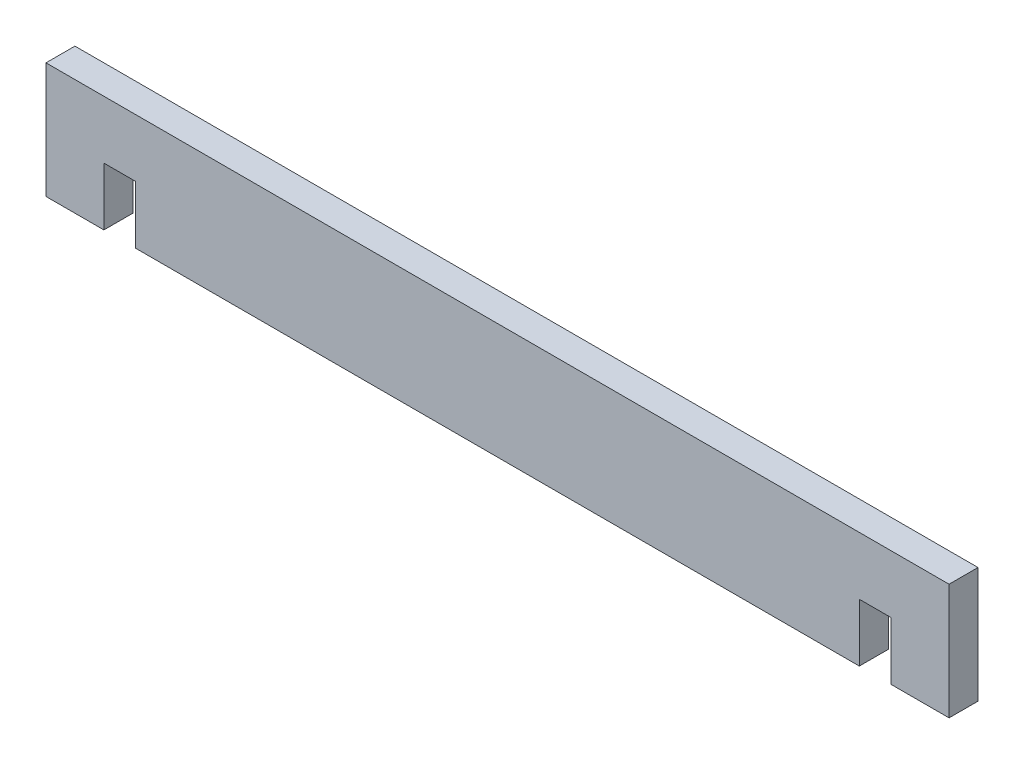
ISO-10303-21;
HEADER;
FILE_DESCRIPTION(('STEP AP214'),'2;1');
FILE_NAME('part.step','',(''),(''),'','','');
FILE_SCHEMA(('AUTOMOTIVE_DESIGN { 1 0 10303 214 1 1 1 1 }'));
ENDSEC;
DATA;
#1=APPLICATION_CONTEXT('core data for automotive mechanical design processes');
#2=APPLICATION_PROTOCOL_DEFINITION('international standard','automotive_design',2000,#1);
#3=PRODUCT_CONTEXT('',#1,'mechanical');
#4=PRODUCT('Part','Part','',(#3));
#5=PRODUCT_RELATED_PRODUCT_CATEGORY('part','',(#4));
#6=PRODUCT_DEFINITION_FORMATION('','',#4);
#7=PRODUCT_DEFINITION_CONTEXT('part definition',#1,'design');
#8=PRODUCT_DEFINITION('design','',#6,#7);
#9=PRODUCT_DEFINITION_SHAPE('','',#8);
#10=(LENGTH_UNIT() NAMED_UNIT(*) SI_UNIT(.MILLI.,.METRE.));
#11=(NAMED_UNIT(*) PLANE_ANGLE_UNIT() SI_UNIT($,.RADIAN.));
#12=(NAMED_UNIT(*) SI_UNIT($,.STERADIAN.) SOLID_ANGLE_UNIT());
#13=UNCERTAINTY_MEASURE_WITH_UNIT(LENGTH_MEASURE(1.E-05),#10,'distance_accuracy_value','');
#14=(GEOMETRIC_REPRESENTATION_CONTEXT(3) GLOBAL_UNCERTAINTY_ASSIGNED_CONTEXT((#13)) GLOBAL_UNIT_ASSIGNED_CONTEXT((#10,
#11,#12)) REPRESENTATION_CONTEXT('',''));
#15=CARTESIAN_POINT('',(0.,0.,0.));
#16=DIRECTION('',(0.,0.,1.));
#17=DIRECTION('',(1.,0.,0.));
#18=AXIS2_PLACEMENT_3D('',#15,#16,#17);
#19=CARTESIAN_POINT('',(0.,0.,10.));
#20=DIRECTION('',(0.,1.,0.));
#21=DIRECTION('',(0.,0.,1.));
#22=AXIS2_PLACEMENT_3D('',#19,#20,#21);
#23=PLANE('',#22);
#24=DIRECTION('',(0.,0.,-1.));
#25=VECTOR('',#24,1.);
#26=CARTESIAN_POINT('',(584.,0.,10.001));
#27=LINE('',#26,#25);
#28=CARTESIAN_POINT('',(584.,0.,10.));
#29=VERTEX_POINT('',#28);
#30=CARTESIAN_POINT('',(584.,0.,-10.));
#31=VERTEX_POINT('',#30);
#32=EDGE_CURVE('E125',#29,#31,#27,.T.);
#33=ORIENTED_EDGE('',*,*,#32,.T.);
#34=DIRECTION('',(1.,0.,0.));
#35=VECTOR('',#34,1.);
#36=CARTESIAN_POINT('',(0.,0.,-10.));
#37=LINE('',#36,#35);
#38=CARTESIAN_POINT('',(624.,0.,-10.));
#39=VERTEX_POINT('',#38);
#40=EDGE_CURVE('E139',#31,#39,#37,.T.);
#41=ORIENTED_EDGE('',*,*,#40,.T.);
#42=DIRECTION('',(0.,0.,-1.));
#43=VECTOR('',#42,1.);
#44=CARTESIAN_POINT('',(624.,0.,10.));
#45=LINE('',#44,#43);
#46=CARTESIAN_POINT('',(624.,0.,10.));
#47=VERTEX_POINT('',#46);
#48=EDGE_CURVE('E40',#47,#39,#45,.T.);
#49=ORIENTED_EDGE('',*,*,#48,.F.);
#50=DIRECTION('',(1.,0.,0.));
#51=VECTOR('',#50,1.);
#52=CARTESIAN_POINT('',(0.,0.,10.));
#53=LINE('',#52,#51);
#54=EDGE_CURVE('E141',#29,#47,#53,.T.);
#55=ORIENTED_EDGE('',*,*,#54,.F.);
#56=EDGE_LOOP('',(#33,#41,#49,#55));
#57=FACE_BOUND('',#56,.T.);
#58=ADVANCED_FACE('F32',(#57),#23,.F.);
#59=DIRECTION('',(0.,0.,-1.));
#60=VECTOR('',#59,1.);
#61=CARTESIAN_POINT('',(562.,0.,10.001));
#62=LINE('',#61,#60);
#63=CARTESIAN_POINT('',(562.,0.,10.));
#64=VERTEX_POINT('',#63);
#65=CARTESIAN_POINT('',(562.,0.,-10.));
#66=VERTEX_POINT('',#65);
#67=EDGE_CURVE('E47',#64,#66,#62,.T.);
#68=ORIENTED_EDGE('',*,*,#67,.F.);
#69=CARTESIAN_POINT('',(62.,0.,10.));
#70=VERTEX_POINT('',#69);
#71=EDGE_CURVE('E181',#70,#64,#53,.T.);
#72=ORIENTED_EDGE('',*,*,#71,.F.);
#73=DIRECTION('',(0.,0.,-1.));
#74=VECTOR('',#73,1.);
#75=CARTESIAN_POINT('',(62.,0.,10.001));
#76=LINE('',#75,#74);
#77=CARTESIAN_POINT('',(62.,0.,-10.));
#78=VERTEX_POINT('',#77);
#79=EDGE_CURVE('E190',#70,#78,#76,.T.);
#80=ORIENTED_EDGE('',*,*,#79,.T.);
#81=EDGE_CURVE('E148',#78,#66,#37,.T.);
#82=ORIENTED_EDGE('',*,*,#81,.T.);
#83=EDGE_LOOP('',(#68,#72,#80,#82));
#84=FACE_BOUND('',#83,.T.);
#85=ADVANCED_FACE('F234',(#84),#23,.F.);
#86=CARTESIAN_POINT('',(0.,0.,10.));
#87=DIRECTION('',(0.,0.,-1.));
#88=DIRECTION('',(-1.,0.,0.));
#89=AXIS2_PLACEMENT_3D('',#86,#87,#88);
#90=PLANE('',#89);
#91=DIRECTION('',(0.,-1.,0.));
#92=VECTOR('',#91,1.);
#93=CARTESIAN_POINT('',(584.,0.,10.));
#94=LINE('',#93,#92);
#95=CARTESIAN_POINT('',(584.,40.,10.));
#96=VERTEX_POINT('',#95);
#97=EDGE_CURVE('E216',#96,#29,#94,.T.);
#98=ORIENTED_EDGE('',*,*,#97,.T.);
#99=ORIENTED_EDGE('',*,*,#54,.T.);
#100=DIRECTION('',(0.,1.,0.));
#101=VECTOR('',#100,1.);
#102=CARTESIAN_POINT('',(624.,0.,10.));
#103=LINE('',#102,#101);
#104=CARTESIAN_POINT('',(624.,80.,10.));
#105=VERTEX_POINT('',#104);
#106=EDGE_CURVE('E174',#47,#105,#103,.T.);
#107=ORIENTED_EDGE('',*,*,#106,.T.);
#108=DIRECTION('',(-1.,0.,0.));
#109=VECTOR('',#108,1.);
#110=CARTESIAN_POINT('',(0.,80.,10.));
#111=LINE('',#110,#109);
#112=CARTESIAN_POINT('',(0.,80.,10.));
#113=VERTEX_POINT('',#112);
#114=EDGE_CURVE('E171',#105,#113,#111,.T.);
#115=ORIENTED_EDGE('',*,*,#114,.T.);
#116=DIRECTION('',(0.,-1.,0.));
#117=VECTOR('',#116,1.);
#118=CARTESIAN_POINT('',(0.,0.,10.));
#119=LINE('',#118,#117);
#120=CARTESIAN_POINT('',(0.,0.,10.));
#121=VERTEX_POINT('',#120);
#122=EDGE_CURVE('E164',#113,#121,#119,.T.);
#123=ORIENTED_EDGE('',*,*,#122,.T.);
#124=CARTESIAN_POINT('',(40.,0.,10.));
#125=VERTEX_POINT('',#124);
#126=EDGE_CURVE('E177',#121,#125,#53,.T.);
#127=ORIENTED_EDGE('',*,*,#126,.T.);
#128=DIRECTION('',(0.,1.,0.));
#129=VECTOR('',#128,1.);
#130=CARTESIAN_POINT('',(40.,0.,10.));
#131=LINE('',#130,#129);
#132=CARTESIAN_POINT('',(40.,40.,10.));
#133=VERTEX_POINT('',#132);
#134=EDGE_CURVE('E197',#125,#133,#131,.T.);
#135=ORIENTED_EDGE('',*,*,#134,.T.);
#136=DIRECTION('',(1.,0.,0.));
#137=VECTOR('',#136,1.);
#138=CARTESIAN_POINT('',(40.,40.,10.));
#139=LINE('',#138,#137);
#140=CARTESIAN_POINT('',(62.,40.,10.));
#141=VERTEX_POINT('',#140);
#142=EDGE_CURVE('E154',#133,#141,#139,.T.);
#143=ORIENTED_EDGE('',*,*,#142,.T.);
#144=DIRECTION('',(0.,-1.,0.));
#145=VECTOR('',#144,1.);
#146=CARTESIAN_POINT('',(62.,0.,10.));
#147=LINE('',#146,#145);
#148=EDGE_CURVE('E200',#141,#70,#147,.T.);
#149=ORIENTED_EDGE('',*,*,#148,.T.);
#150=ORIENTED_EDGE('',*,*,#71,.T.);
#151=DIRECTION('',(0.,1.,0.));
#152=VECTOR('',#151,1.);
#153=CARTESIAN_POINT('',(562.,0.,10.));
#154=LINE('',#153,#152);
#155=CARTESIAN_POINT('',(562.,40.,10.));
#156=VERTEX_POINT('',#155);
#157=EDGE_CURVE('E142',#64,#156,#154,.T.);
#158=ORIENTED_EDGE('',*,*,#157,.T.);
#159=DIRECTION('',(1.,0.,0.));
#160=VECTOR('',#159,1.);
#161=CARTESIAN_POINT('',(562.,40.,10.));
#162=LINE('',#161,#160);
#163=EDGE_CURVE('E133',#156,#96,#162,.T.);
#164=ORIENTED_EDGE('',*,*,#163,.T.);
#165=EDGE_LOOP('',(#98,#99,#107,#115,#123,#127,#135,#143,#149,#150,#158,#164));
#166=FACE_BOUND('',#165,.T.);
#167=ADVANCED_FACE('F239',(#166),#90,.F.);
#168=CARTESIAN_POINT('',(0.,0.,-10.));
#169=DIRECTION('',(0.,0.,-1.));
#170=DIRECTION('',(-1.,0.,0.));
#171=AXIS2_PLACEMENT_3D('',#168,#169,#170);
#172=PLANE('',#171);
#173=ORIENTED_EDGE('',*,*,#40,.F.);
#174=DIRECTION('',(0.,1.,0.));
#175=VECTOR('',#174,1.);
#176=CARTESIAN_POINT('',(584.,0.,-10.));
#177=LINE('',#176,#175);
#178=CARTESIAN_POINT('',(584.,40.,-10.));
#179=VERTEX_POINT('',#178);
#180=EDGE_CURVE('E122',#31,#179,#177,.T.);
#181=ORIENTED_EDGE('',*,*,#180,.T.);
#182=DIRECTION('',(-1.,0.,0.));
#183=VECTOR('',#182,1.);
#184=CARTESIAN_POINT('',(562.,40.,-10.));
#185=LINE('',#184,#183);
#186=CARTESIAN_POINT('',(562.,40.,-10.));
#187=VERTEX_POINT('',#186);
#188=EDGE_CURVE('E221',#179,#187,#185,.T.);
#189=ORIENTED_EDGE('',*,*,#188,.T.);
#190=DIRECTION('',(0.,-1.,0.));
#191=VECTOR('',#190,1.);
#192=CARTESIAN_POINT('',(562.,0.,-10.));
#193=LINE('',#192,#191);
#194=EDGE_CURVE('E134',#187,#66,#193,.T.);
#195=ORIENTED_EDGE('',*,*,#194,.T.);
#196=ORIENTED_EDGE('',*,*,#81,.F.);
#197=DIRECTION('',(0.,1.,0.));
#198=VECTOR('',#197,1.);
#199=CARTESIAN_POINT('',(62.,0.,-10.));
#200=LINE('',#199,#198);
#201=CARTESIAN_POINT('',(62.,40.,-10.));
#202=VERTEX_POINT('',#201);
#203=EDGE_CURVE('E207',#78,#202,#200,.T.);
#204=ORIENTED_EDGE('',*,*,#203,.T.);
#205=DIRECTION('',(-1.,0.,0.));
#206=VECTOR('',#205,1.);
#207=CARTESIAN_POINT('',(40.,40.,-10.));
#208=LINE('',#207,#206);
#209=CARTESIAN_POINT('',(40.,40.,-10.));
#210=VERTEX_POINT('',#209);
#211=EDGE_CURVE('E204',#202,#210,#208,.T.);
#212=ORIENTED_EDGE('',*,*,#211,.T.);
#213=DIRECTION('',(0.,-1.,0.));
#214=VECTOR('',#213,1.);
#215=CARTESIAN_POINT('',(40.,0.,-10.));
#216=LINE('',#215,#214);
#217=CARTESIAN_POINT('',(40.,0.,-10.));
#218=VERTEX_POINT('',#217);
#219=EDGE_CURVE('E55',#210,#218,#216,.T.);
#220=ORIENTED_EDGE('',*,*,#219,.T.);
#221=CARTESIAN_POINT('',(0.,0.,-10.));
#222=VERTEX_POINT('',#221);
#223=EDGE_CURVE('E151',#222,#218,#37,.T.);
#224=ORIENTED_EDGE('',*,*,#223,.F.);
#225=DIRECTION('',(0.,-1.,0.));
#226=VECTOR('',#225,1.);
#227=CARTESIAN_POINT('',(0.,0.,-10.));
#228=LINE('',#227,#226);
#229=CARTESIAN_POINT('',(0.,80.,-10.));
#230=VERTEX_POINT('',#229);
#231=EDGE_CURVE('E149',#230,#222,#228,.T.);
#232=ORIENTED_EDGE('',*,*,#231,.F.);
#233=DIRECTION('',(-1.,0.,0.));
#234=VECTOR('',#233,1.);
#235=CARTESIAN_POINT('',(0.,80.,-10.));
#236=LINE('',#235,#234);
#237=CARTESIAN_POINT('',(624.,80.,-10.));
#238=VERTEX_POINT('',#237);
#239=EDGE_CURVE('E160',#238,#230,#236,.T.);
#240=ORIENTED_EDGE('',*,*,#239,.F.);
#241=DIRECTION('',(0.,1.,0.));
#242=VECTOR('',#241,1.);
#243=CARTESIAN_POINT('',(624.,0.,-10.));
#244=LINE('',#243,#242);
#245=EDGE_CURVE('E147',#39,#238,#244,.T.);
#246=ORIENTED_EDGE('',*,*,#245,.F.);
#247=EDGE_LOOP('',(#173,#181,#189,#195,#196,#204,#212,#220,#224,#232,#240,#246));
#248=FACE_BOUND('',#247,.T.);
#249=ADVANCED_FACE('F145',(#248),#172,.T.);
#250=DIRECTION('',(0.,0.,-1.));
#251=VECTOR('',#250,1.);
#252=CARTESIAN_POINT('',(40.,0.,10.001));
#253=LINE('',#252,#251);
#254=EDGE_CURVE('E188',#125,#218,#253,.T.);
#255=ORIENTED_EDGE('',*,*,#254,.F.);
#256=ORIENTED_EDGE('',*,*,#126,.F.);
#257=DIRECTION('',(0.,0.,-1.));
#258=VECTOR('',#257,1.);
#259=CARTESIAN_POINT('',(0.,0.,10.));
#260=LINE('',#259,#258);
#261=EDGE_CURVE('E11',#121,#222,#260,.T.);
#262=ORIENTED_EDGE('',*,*,#261,.T.);
#263=ORIENTED_EDGE('',*,*,#223,.T.);
#264=EDGE_LOOP('',(#255,#256,#262,#263));
#265=FACE_BOUND('',#264,.T.);
#266=ADVANCED_FACE('F235',(#265),#23,.F.);
#267=CARTESIAN_POINT('',(0.,0.,10.));
#268=DIRECTION('',(1.,0.,0.));
#269=DIRECTION('',(0.,0.,-1.));
#270=AXIS2_PLACEMENT_3D('',#267,#268,#269);
#271=PLANE('',#270);
#272=ORIENTED_EDGE('',*,*,#231,.T.);
#273=ORIENTED_EDGE('',*,*,#261,.F.);
#274=ORIENTED_EDGE('',*,*,#122,.F.);
#275=DIRECTION('',(0.,0.,-1.));
#276=VECTOR('',#275,1.);
#277=CARTESIAN_POINT('',(0.,80.,10.));
#278=LINE('',#277,#276);
#279=EDGE_CURVE('E167',#113,#230,#278,.T.);
#280=ORIENTED_EDGE('',*,*,#279,.T.);
#281=EDGE_LOOP('',(#272,#273,#274,#280));
#282=FACE_BOUND('',#281,.T.);
#283=ADVANCED_FACE('F34',(#282),#271,.F.);
#284=CARTESIAN_POINT('',(624.,0.,10.));
#285=DIRECTION('',(-1.,0.,0.));
#286=DIRECTION('',(0.,0.,1.));
#287=AXIS2_PLACEMENT_3D('',#284,#285,#286);
#288=PLANE('',#287);
#289=ORIENTED_EDGE('',*,*,#245,.T.);
#290=DIRECTION('',(0.,0.,-1.));
#291=VECTOR('',#290,1.);
#292=CARTESIAN_POINT('',(624.,80.,10.));
#293=LINE('',#292,#291);
#294=EDGE_CURVE('E170',#105,#238,#293,.T.);
#295=ORIENTED_EDGE('',*,*,#294,.F.);
#296=ORIENTED_EDGE('',*,*,#106,.F.);
#297=ORIENTED_EDGE('',*,*,#48,.T.);
#298=EDGE_LOOP('',(#289,#295,#296,#297));
#299=FACE_BOUND('',#298,.T.);
#300=ADVANCED_FACE('F173',(#299),#288,.F.);
#301=CARTESIAN_POINT('',(0.,80.,10.));
#302=DIRECTION('',(0.,-1.,0.));
#303=DIRECTION('',(0.,0.,-1.));
#304=AXIS2_PLACEMENT_3D('',#301,#302,#303);
#305=PLANE('',#304);
#306=ORIENTED_EDGE('',*,*,#239,.T.);
#307=ORIENTED_EDGE('',*,*,#279,.F.);
#308=ORIENTED_EDGE('',*,*,#114,.F.);
#309=ORIENTED_EDGE('',*,*,#294,.T.);
#310=EDGE_LOOP('',(#306,#307,#308,#309));
#311=FACE_BOUND('',#310,.T.);
#312=ADVANCED_FACE('F260',(#311),#305,.F.);
#313=CARTESIAN_POINT('',(40.,0.,10.001));
#314=DIRECTION('',(1.,0.,0.));
#315=DIRECTION('',(0.,1.,0.));
#316=AXIS2_PLACEMENT_3D('',#313,#314,#315);
#317=PLANE('',#316);
#318=ORIENTED_EDGE('',*,*,#254,.T.);
#319=ORIENTED_EDGE('',*,*,#219,.F.);
#320=DIRECTION('',(0.,0.,-1.));
#321=VECTOR('',#320,1.);
#322=CARTESIAN_POINT('',(40.,40.,10.001));
#323=LINE('',#322,#321);
#324=EDGE_CURVE('E195',#133,#210,#323,.T.);
#325=ORIENTED_EDGE('',*,*,#324,.F.);
#326=ORIENTED_EDGE('',*,*,#134,.F.);
#327=EDGE_LOOP('',(#318,#319,#325,#326));
#328=FACE_BOUND('',#327,.T.);
#329=ADVANCED_FACE('F257',(#328),#317,.T.);
#330=CARTESIAN_POINT('',(62.,0.,10.001));
#331=DIRECTION('',(-1.,0.,0.));
#332=DIRECTION('',(0.,0.,1.));
#333=AXIS2_PLACEMENT_3D('',#330,#331,#332);
#334=PLANE('',#333);
#335=DIRECTION('',(0.,0.,-1.));
#336=VECTOR('',#335,1.);
#337=CARTESIAN_POINT('',(62.,40.,10.001));
#338=LINE('',#337,#336);
#339=EDGE_CURVE('E193',#141,#202,#338,.T.);
#340=ORIENTED_EDGE('',*,*,#339,.T.);
#341=ORIENTED_EDGE('',*,*,#203,.F.);
#342=ORIENTED_EDGE('',*,*,#79,.F.);
#343=ORIENTED_EDGE('',*,*,#148,.F.);
#344=EDGE_LOOP('',(#340,#341,#342,#343));
#345=FACE_BOUND('',#344,.T.);
#346=ADVANCED_FACE('F259',(#345),#334,.T.);
#347=CARTESIAN_POINT('',(40.,40.,10.001));
#348=DIRECTION('',(0.,-1.,0.));
#349=DIRECTION('',(0.,0.,-1.));
#350=AXIS2_PLACEMENT_3D('',#347,#348,#349);
#351=PLANE('',#350);
#352=ORIENTED_EDGE('',*,*,#324,.T.);
#353=ORIENTED_EDGE('',*,*,#211,.F.);
#354=ORIENTED_EDGE('',*,*,#339,.F.);
#355=ORIENTED_EDGE('',*,*,#142,.F.);
#356=EDGE_LOOP('',(#352,#353,#354,#355));
#357=FACE_BOUND('',#356,.T.);
#358=ADVANCED_FACE('F256',(#357),#351,.T.);
#359=CARTESIAN_POINT('',(584.,0.,10.001));
#360=DIRECTION('',(-1.,0.,0.));
#361=DIRECTION('',(0.,0.,1.));
#362=AXIS2_PLACEMENT_3D('',#359,#360,#361);
#363=PLANE('',#362);
#364=DIRECTION('',(0.,0.,-1.));
#365=VECTOR('',#364,1.);
#366=CARTESIAN_POINT('',(584.,40.,10.001));
#367=LINE('',#366,#365);
#368=EDGE_CURVE('E128',#96,#179,#367,.T.);
#369=ORIENTED_EDGE('',*,*,#368,.T.);
#370=ORIENTED_EDGE('',*,*,#180,.F.);
#371=ORIENTED_EDGE('',*,*,#32,.F.);
#372=ORIENTED_EDGE('',*,*,#97,.F.);
#373=EDGE_LOOP('',(#369,#370,#371,#372));
#374=FACE_BOUND('',#373,.T.);
#375=ADVANCED_FACE('F124',(#374),#363,.T.);
#376=CARTESIAN_POINT('',(562.,40.,10.001));
#377=DIRECTION('',(0.,-1.,0.));
#378=DIRECTION('',(0.,0.,-1.));
#379=AXIS2_PLACEMENT_3D('',#376,#377,#378);
#380=PLANE('',#379);
#381=DIRECTION('',(0.,0.,-1.));
#382=VECTOR('',#381,1.);
#383=CARTESIAN_POINT('',(562.,40.,10.001));
#384=LINE('',#383,#382);
#385=EDGE_CURVE('E213',#156,#187,#384,.T.);
#386=ORIENTED_EDGE('',*,*,#385,.T.);
#387=ORIENTED_EDGE('',*,*,#188,.F.);
#388=ORIENTED_EDGE('',*,*,#368,.F.);
#389=ORIENTED_EDGE('',*,*,#163,.F.);
#390=EDGE_LOOP('',(#386,#387,#388,#389));
#391=FACE_BOUND('',#390,.T.);
#392=ADVANCED_FACE('F224',(#391),#380,.T.);
#393=CARTESIAN_POINT('',(562.,0.,10.001));
#394=DIRECTION('',(1.,0.,0.));
#395=DIRECTION('',(0.,0.,-1.));
#396=AXIS2_PLACEMENT_3D('',#393,#394,#395);
#397=PLANE('',#396);
#398=ORIENTED_EDGE('',*,*,#67,.T.);
#399=ORIENTED_EDGE('',*,*,#194,.F.);
#400=ORIENTED_EDGE('',*,*,#385,.F.);
#401=ORIENTED_EDGE('',*,*,#157,.F.);
#402=EDGE_LOOP('',(#398,#399,#400,#401));
#403=FACE_BOUND('',#402,.T.);
#404=ADVANCED_FACE('F226',(#403),#397,.T.);
#405=CLOSED_SHELL('',(#58,#85,#167,#249,#266,#283,#300,#312,#329,#346,#358,#375,#392,#404));
#406=MANIFOLD_SOLID_BREP('B2',#405);
#407=ADVANCED_BREP_SHAPE_REPRESENTATION('',(#18,#406),#14);
#408=SHAPE_DEFINITION_REPRESENTATION(#9,#407);
ENDSEC;
END-ISO-10303-21;
